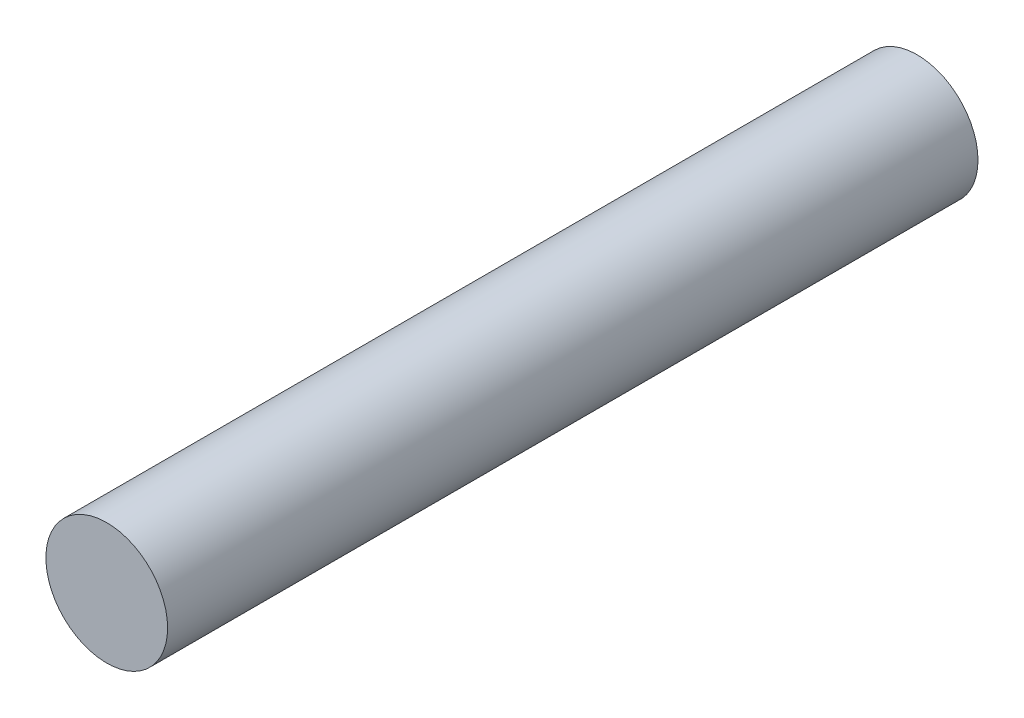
ISO-10303-21;
HEADER;
FILE_DESCRIPTION(('STEP AP214'),'2;1');
FILE_NAME('part.step','',(''),(''),'','','');
FILE_SCHEMA(('AUTOMOTIVE_DESIGN { 1 0 10303 214 1 1 1 1 }'));
ENDSEC;
DATA;
#1=APPLICATION_CONTEXT('core data for automotive mechanical design processes');
#2=APPLICATION_PROTOCOL_DEFINITION('international standard','automotive_design',2000,#1);
#3=PRODUCT_CONTEXT('',#1,'mechanical');
#4=PRODUCT('Part','Part','',(#3));
#5=PRODUCT_RELATED_PRODUCT_CATEGORY('part','',(#4));
#6=PRODUCT_DEFINITION_FORMATION('','',#4);
#7=PRODUCT_DEFINITION_CONTEXT('part definition',#1,'design');
#8=PRODUCT_DEFINITION('design','',#6,#7);
#9=PRODUCT_DEFINITION_SHAPE('','',#8);
#10=(LENGTH_UNIT() NAMED_UNIT(*) SI_UNIT(.MILLI.,.METRE.));
#11=(NAMED_UNIT(*) PLANE_ANGLE_UNIT() SI_UNIT($,.RADIAN.));
#12=(NAMED_UNIT(*) SI_UNIT($,.STERADIAN.) SOLID_ANGLE_UNIT());
#13=UNCERTAINTY_MEASURE_WITH_UNIT(LENGTH_MEASURE(1.E-05),#10,'distance_accuracy_value','');
#14=(GEOMETRIC_REPRESENTATION_CONTEXT(3) GLOBAL_UNCERTAINTY_ASSIGNED_CONTEXT((#13)) GLOBAL_UNIT_ASSIGNED_CONTEXT((#10,
#11,#12)) REPRESENTATION_CONTEXT('',''));
#15=CARTESIAN_POINT('',(0.,0.,0.));
#16=DIRECTION('',(0.,0.,1.));
#17=DIRECTION('',(1.,0.,0.));
#18=AXIS2_PLACEMENT_3D('',#15,#16,#17);
#19=CARTESIAN_POINT('',(0.,0.,253.));
#20=DIRECTION('',(0.,0.,-1.));
#21=DIRECTION('',(-1.,0.,0.));
#22=AXIS2_PLACEMENT_3D('',#19,#20,#21);
#23=CYLINDRICAL_SURFACE('',#22,38.);
#24=CARTESIAN_POINT('',(0.,0.,253.));
#25=DIRECTION('',(0.,0.,1.));
#26=DIRECTION('',(1.,0.,0.));
#27=AXIS2_PLACEMENT_3D('',#24,#25,#26);
#28=CIRCLE('',#27,38.);
#29=CARTESIAN_POINT('',(38.,0.,253.));
#30=VERTEX_POINT('',#29);
#31=EDGE_CURVE('E10',#30,#30,#28,.T.);
#32=ORIENTED_EDGE('',*,*,#31,.F.);
#33=EDGE_LOOP('',(#32));
#34=FACE_BOUND('',#33,.T.);
#35=CARTESIAN_POINT('',(0.,0.,-253.));
#36=DIRECTION('',(0.,0.,1.));
#37=DIRECTION('',(1.,0.,0.));
#38=AXIS2_PLACEMENT_3D('',#35,#36,#37);
#39=CIRCLE('',#38,38.);
#40=CARTESIAN_POINT('',(38.,0.,-253.));
#41=VERTEX_POINT('',#40);
#42=EDGE_CURVE('E34',#41,#41,#39,.T.);
#43=ORIENTED_EDGE('',*,*,#42,.T.);
#44=EDGE_LOOP('',(#43));
#45=FACE_BOUND('',#44,.T.);
#46=ADVANCED_FACE('F31',(#34,#45),#23,.T.);
#47=CARTESIAN_POINT('',(0.,0.,253.));
#48=DIRECTION('',(0.,0.,1.));
#49=DIRECTION('',(1.,0.,0.));
#50=AXIS2_PLACEMENT_3D('',#47,#48,#49);
#51=PLANE('',#50);
#52=ORIENTED_EDGE('',*,*,#31,.T.);
#53=EDGE_LOOP('',(#52));
#54=FACE_BOUND('',#53,.T.);
#55=ADVANCED_FACE('F46',(#54),#51,.T.);
#56=CARTESIAN_POINT('',(0.,0.,-253.));
#57=DIRECTION('',(0.,0.,1.));
#58=DIRECTION('',(1.,0.,0.));
#59=AXIS2_PLACEMENT_3D('',#56,#57,#58);
#60=PLANE('',#59);
#61=ORIENTED_EDGE('',*,*,#42,.F.);
#62=EDGE_LOOP('',(#61));
#63=FACE_BOUND('',#62,.T.);
#64=ADVANCED_FACE('F44',(#63),#60,.F.);
#65=CLOSED_SHELL('',(#46,#55,#64));
#66=MANIFOLD_SOLID_BREP('B2',#65);
#67=ADVANCED_BREP_SHAPE_REPRESENTATION('',(#18,#66),#14);
#68=SHAPE_DEFINITION_REPRESENTATION(#9,#67);
ENDSEC;
END-ISO-10303-21;
